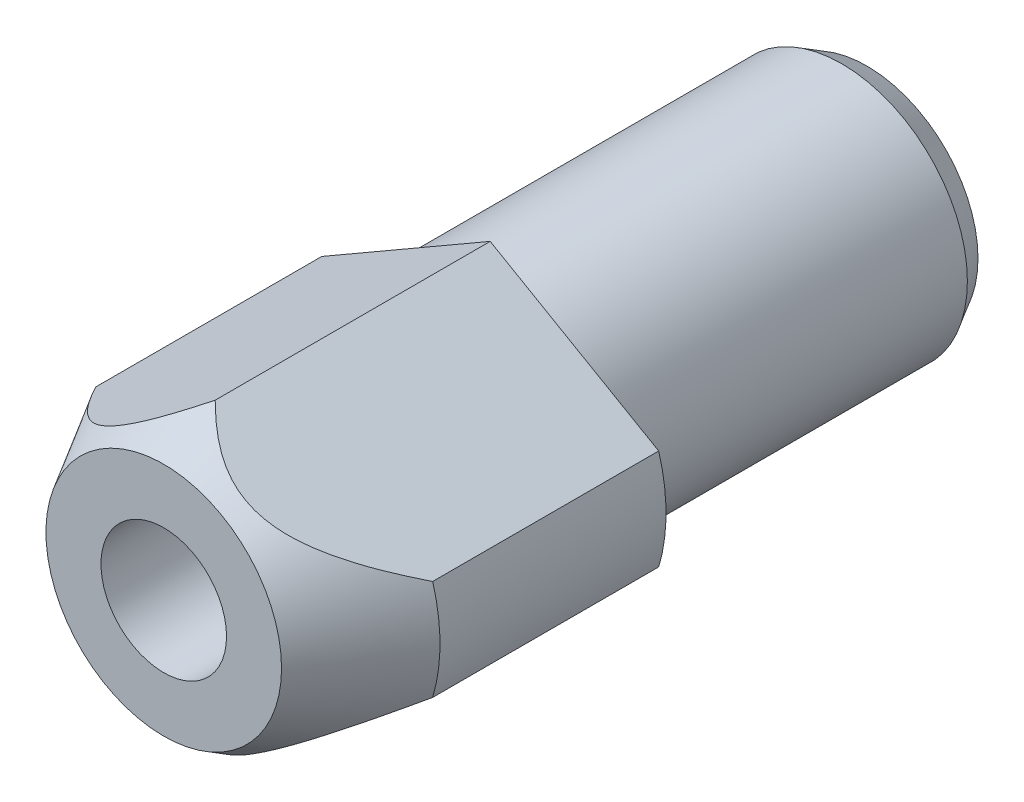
ISO-10303-21;
HEADER;
FILE_DESCRIPTION(('STEP AP214'),'2;1');
FILE_NAME('part.step','',(''),(''),'','','');
FILE_SCHEMA(('AUTOMOTIVE_DESIGN { 1 0 10303 214 1 1 1 1 }'));
ENDSEC;
DATA;
#1=APPLICATION_CONTEXT('core data for automotive mechanical design processes');
#2=APPLICATION_PROTOCOL_DEFINITION('international standard','automotive_design',2000,#1);
#3=PRODUCT_CONTEXT('',#1,'mechanical');
#4=PRODUCT('Part','Part','',(#3));
#5=PRODUCT_RELATED_PRODUCT_CATEGORY('part','',(#4));
#6=PRODUCT_DEFINITION_FORMATION('','',#4);
#7=PRODUCT_DEFINITION_CONTEXT('part definition',#1,'design');
#8=PRODUCT_DEFINITION('design','',#6,#7);
#9=PRODUCT_DEFINITION_SHAPE('','',#8);
#10=(LENGTH_UNIT() NAMED_UNIT(*) SI_UNIT(.MILLI.,.METRE.));
#11=(NAMED_UNIT(*) PLANE_ANGLE_UNIT() SI_UNIT($,.RADIAN.));
#12=(NAMED_UNIT(*) SI_UNIT($,.STERADIAN.) SOLID_ANGLE_UNIT());
#13=UNCERTAINTY_MEASURE_WITH_UNIT(LENGTH_MEASURE(1.E-05),#10,'distance_accuracy_value','');
#14=(GEOMETRIC_REPRESENTATION_CONTEXT(3) GLOBAL_UNCERTAINTY_ASSIGNED_CONTEXT((#13)) GLOBAL_UNIT_ASSIGNED_CONTEXT((#10,
#11,#12)) REPRESENTATION_CONTEXT('',''));
#15=CARTESIAN_POINT('',(0.,0.,0.));
#16=DIRECTION('',(0.,0.,1.));
#17=DIRECTION('',(1.,0.,0.));
#18=AXIS2_PLACEMENT_3D('',#15,#16,#17);
#19=CARTESIAN_POINT('',(5.,0.,0.));
#20=DIRECTION('',(0.,0.,1.));
#21=DIRECTION('',(1.,0.,0.));
#22=AXIS2_PLACEMENT_3D('',#19,#20,#21);
#23=PLANE('',#22);
#24=CARTESIAN_POINT('',(0.,0.,0.));
#25=DIRECTION('',(0.,0.,1.));
#26=DIRECTION('',(1.,0.,0.));
#27=AXIS2_PLACEMENT_3D('',#24,#25,#26);
#28=CIRCLE('',#27,5.);
#29=CARTESIAN_POINT('',(5.,0.,0.));
#30=VERTEX_POINT('',#29);
#31=EDGE_CURVE('E96',#30,#30,#28,.T.);
#32=ORIENTED_EDGE('',*,*,#31,.T.);
#33=EDGE_LOOP('',(#32));
#34=FACE_BOUND('',#33,.T.);
#35=DIRECTION('',(-0.866025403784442,0.5,0.));
#36=VECTOR('',#35,1.);
#37=CARTESIAN_POINT('',(6.70820393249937,2.,0.));
#38=LINE('',#37,#36);
#39=CARTESIAN_POINT('',(6.70820393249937,2.,0.));
#40=VERTEX_POINT('',#39);
#41=CARTESIAN_POINT('',(0.,5.87298334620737,0.));
#42=VERTEX_POINT('',#41);
#43=EDGE_CURVE('E79',#40,#42,#38,.T.);
#44=ORIENTED_EDGE('',*,*,#43,.F.);
#45=CARTESIAN_POINT('',(0.,0.,0.));
#46=DIRECTION('',(0.,0.,1.));
#47=DIRECTION('',(1.,0.,0.));
#48=AXIS2_PLACEMENT_3D('',#45,#46,#47);
#49=CIRCLE('',#48,7.);
#50=CARTESIAN_POINT('',(6.70820393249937,-2.,0.));
#51=VERTEX_POINT('',#50);
#52=EDGE_CURVE('E92',#51,#40,#49,.T.);
#53=ORIENTED_EDGE('',*,*,#52,.F.);
#54=DIRECTION('',(-0.866025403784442,-0.5,0.));
#55=VECTOR('',#54,1.);
#56=CARTESIAN_POINT('',(6.70820393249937,-2.,0.));
#57=LINE('',#56,#55);
#58=CARTESIAN_POINT('',(0.,-5.87298334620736,0.));
#59=VERTEX_POINT('',#58);
#60=EDGE_CURVE('E201',#51,#59,#57,.T.);
#61=ORIENTED_EDGE('',*,*,#60,.T.);
#62=DIRECTION('',(0.866025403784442,-0.5,0.));
#63=VECTOR('',#62,1.);
#64=CARTESIAN_POINT('',(-6.70820393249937,-2.,0.));
#65=LINE('',#64,#63);
#66=CARTESIAN_POINT('',(-6.70820393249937,-2.,0.));
#67=VERTEX_POINT('',#66);
#68=EDGE_CURVE('E91',#67,#59,#65,.T.);
#69=ORIENTED_EDGE('',*,*,#68,.F.);
#70=CARTESIAN_POINT('',(-6.70820393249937,2.,0.));
#71=VERTEX_POINT('',#70);
#72=EDGE_CURVE('E85',#71,#67,#49,.T.);
#73=ORIENTED_EDGE('',*,*,#72,.F.);
#74=DIRECTION('',(0.866025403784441,0.5,0.));
#75=VECTOR('',#74,1.);
#76=CARTESIAN_POINT('',(-6.70820393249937,2.,0.));
#77=LINE('',#76,#75);
#78=EDGE_CURVE('E71',#71,#42,#77,.T.);
#79=ORIENTED_EDGE('',*,*,#78,.T.);
#80=EDGE_LOOP('',(#44,#53,#61,#69,#73,#79));
#81=FACE_BOUND('',#80,.T.);
#82=ADVANCED_FACE('F14',(#34,#81),#23,.F.);
#83=CARTESIAN_POINT('',(0.,0.,30.));
#84=DIRECTION('',(0.,0.,1.));
#85=DIRECTION('',(1.,0.,0.));
#86=AXIS2_PLACEMENT_3D('',#83,#84,#85);
#87=CYLINDRICAL_SURFACE('',#86,7.);
#88=DIRECTION('',(0.,0.,1.));
#89=VECTOR('',#88,1.);
#90=CARTESIAN_POINT('',(6.70820393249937,2.,0.));
#91=LINE('',#90,#89);
#92=CARTESIAN_POINT('',(6.70820393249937,2.,9.));
#93=VERTEX_POINT('',#92);
#94=EDGE_CURVE('E197',#40,#93,#91,.T.);
#95=ORIENTED_EDGE('',*,*,#94,.T.);
#96=CARTESIAN_POINT('',(0.,0.,9.));
#97=DIRECTION('',(0.,0.,1.));
#98=DIRECTION('',(1.,0.,0.));
#99=AXIS2_PLACEMENT_3D('',#96,#97,#98);
#100=CIRCLE('',#99,7.);
#101=CARTESIAN_POINT('',(6.70820393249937,-2.,9.));
#102=VERTEX_POINT('',#101);
#103=EDGE_CURVE('E93',#102,#93,#100,.T.);
#104=ORIENTED_EDGE('',*,*,#103,.F.);
#105=DIRECTION('',(0.,0.,1.));
#106=VECTOR('',#105,1.);
#107=CARTESIAN_POINT('',(6.70820393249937,-2.,0.));
#108=LINE('',#107,#106);
#109=EDGE_CURVE('E209',#51,#102,#108,.T.);
#110=ORIENTED_EDGE('',*,*,#109,.F.);
#111=ORIENTED_EDGE('',*,*,#52,.T.);
#112=EDGE_LOOP('',(#95,#104,#110,#111));
#113=FACE_BOUND('',#112,.T.);
#114=ADVANCED_FACE('F150',(#113),#87,.T.);
#115=CARTESIAN_POINT('',(0.,0.,9.));
#116=DIRECTION('',(0.,0.,-1.));
#117=DIRECTION('',(-1.,0.,0.));
#118=AXIS2_PLACEMENT_3D('',#115,#116,#117);
#119=CONICAL_SURFACE('',#118,7.,0.523598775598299);
#120=CARTESIAN_POINT('',(0.,0.,13.));
#121=DIRECTION('',(0.,0.,1.));
#122=DIRECTION('',(1.,0.,0.));
#123=AXIS2_PLACEMENT_3D('',#120,#121,#122);
#124=CIRCLE('',#123,4.69059892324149);
#125=CARTESIAN_POINT('',(4.69059892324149,0.,13.));
#126=VERTEX_POINT('',#125);
#127=EDGE_CURVE('E191',#126,#126,#124,.T.);
#128=ORIENTED_EDGE('',*,*,#127,.F.);
#129=EDGE_LOOP('',(#128));
#130=FACE_BOUND('',#129,.T.);
#131=CARTESIAN_POINT('',(-0.000200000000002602,5.8730988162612,10.9518500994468));
#132=CARTESIAN_POINT('',(0.0529864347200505,5.84239161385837,11.0050342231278));
#133=CARTESIAN_POINT('',(0.106703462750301,5.81137807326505,11.0575091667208));
#134=CARTESIAN_POINT('',(0.215315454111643,5.74867091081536,11.1608430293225));
#135=CARTESIAN_POINT('',(0.27021074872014,5.7169770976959,11.2117014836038));
#136=CARTESIAN_POINT('',(0.437358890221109,5.62047407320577,11.3620190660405));
#137=CARTESIAN_POINT('',(0.551534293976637,5.55455487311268,11.4586741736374));
#138=CARTESIAN_POINT('',(0.788819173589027,5.41755838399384,11.6445045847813));
#139=CARTESIAN_POINT('',(0.91208446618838,5.34639113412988,11.7334170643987));
#140=CARTESIAN_POINT('',(1.16529399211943,5.20020054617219,11.8970695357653));
#141=CARTESIAN_POINT('',(1.29522262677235,5.12518621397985,11.971840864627));
#142=CARTESIAN_POINT('',(1.50113825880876,5.0063007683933,12.0728579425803));
#143=CARTESIAN_POINT('',(1.57471376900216,4.96382192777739,12.1056861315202));
#144=CARTESIAN_POINT('',(1.72379175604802,4.87775171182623,12.1649793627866));
#145=CARTESIAN_POINT('',(1.79929437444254,4.83416025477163,12.1914439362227));
#146=CARTESIAN_POINT('',(1.95132510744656,4.74638527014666,12.2369981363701));
#147=CARTESIAN_POINT('',(2.02784035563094,4.7022091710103,12.2561445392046));
#148=CARTESIAN_POINT('',(2.18202244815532,4.61319209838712,12.2866655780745));
#149=CARTESIAN_POINT('',(2.25968907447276,4.56835125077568,12.2980416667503));
#150=CARTESIAN_POINT('',(2.4163505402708,4.47790271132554,12.3126377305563));
#151=CARTESIAN_POINT('',(2.49535097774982,4.43229178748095,12.3157786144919));
#152=CARTESIAN_POINT('',(2.65325881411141,4.34112365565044,12.3135398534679));
#153=CARTESIAN_POINT('',(2.73216621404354,4.29556644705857,12.3081603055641));
#154=CARTESIAN_POINT('',(2.88933707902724,4.20482380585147,12.2890977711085));
#155=CARTESIAN_POINT('',(2.96759940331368,4.15963903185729,12.2754023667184));
#156=CARTESIAN_POINT('',(3.12283420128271,4.07001417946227,12.2402403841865));
#157=CARTESIAN_POINT('',(3.19980587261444,4.0255745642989,12.2187691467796));
#158=CARTESIAN_POINT('',(3.37375422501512,3.92514543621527,12.1616717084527));
#159=CARTESIAN_POINT('',(3.47016647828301,3.86948179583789,12.1237542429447));
#160=CARTESIAN_POINT('',(3.65967695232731,3.76006787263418,12.038108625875));
#161=CARTESIAN_POINT('',(3.7527731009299,3.70631878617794,11.9903744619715));
#162=CARTESIAN_POINT('',(3.93635982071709,3.60032494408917,11.8863630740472));
#163=CARTESIAN_POINT('',(4.02681802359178,3.54809887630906,11.8300103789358));
#164=CARTESIAN_POINT('',(4.20431504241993,3.44562092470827,11.710654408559));
#165=CARTESIAN_POINT('',(4.29135478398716,3.39536850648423,11.6476529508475));
#166=CARTESIAN_POINT('',(4.49230790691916,3.27934816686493,11.4931903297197));
#167=CARTESIAN_POINT('',(4.60493225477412,3.21432446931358,11.3995008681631));
#168=CARTESIAN_POINT('',(4.82523970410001,3.0871299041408,11.2046332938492));
#169=CARTESIAN_POINT('',(4.93292034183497,3.02496045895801,11.1034515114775));
#170=CARTESIAN_POINT('',(5.14433636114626,2.90289936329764,10.8950283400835));
#171=CARTESIAN_POINT('',(5.24805862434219,2.84301528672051,10.7877693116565));
#172=CARTESIAN_POINT('',(5.45185763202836,2.72535187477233,10.5687242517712));
#173=CARTESIAN_POINT('',(5.55193392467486,2.66757280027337,10.4569376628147));
#174=CARTESIAN_POINT('',(5.74358661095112,2.55692207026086,10.235978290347));
#175=CARTESIAN_POINT('',(5.83532868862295,2.50395475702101,10.1269963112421));
#176=CARTESIAN_POINT('',(6.01641515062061,2.39940443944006,9.90639842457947));
#177=CARTESIAN_POINT('',(6.1057593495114,2.34782154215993,9.79478231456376));
#178=CARTESIAN_POINT('',(6.2816778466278,2.24625495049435,9.5702575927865));
#179=CARTESIAN_POINT('',(6.36826828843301,2.19626193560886,9.45736579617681));
#180=CARTESIAN_POINT('',(6.53963078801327,2.09732575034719,9.22980351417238));
#181=CARTESIAN_POINT('',(6.62440328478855,2.04838232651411,9.11513346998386));
#182=CARTESIAN_POINT('',(6.70840393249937,1.99988452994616,8.99972516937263));
#183=B_SPLINE_CURVE_WITH_KNOTS('',3,(#131,#132,#133,#134,#135,#136,#137,#138,#139,#140,#141,
#142,#143,#144,#145,#146,#147,#148,#149,#150,#151,#152,#153,#154,#155,#156,#157,#158,#159,#160,
#161,#162,#163,#164,#165,#166,#167,#168,#169,#170,#171,#172,#173,#174,#175,#176,#177,#178,#179,
#180,#181,#182),.UNSPECIFIED.,.F.,.F.,(4,2,2,2,2,2,2,2,2,2,2,2,2,2,2,2,2,2,2,2,2,2,2,2,2,4),(0.,
0.243715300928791,0.487500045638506,0.977552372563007,1.48046379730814,1.98224735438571,
2.25527955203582,2.52833186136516,2.79922055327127,3.0700585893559,3.34348839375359,
3.61691508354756,3.8907510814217,4.16475143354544,4.51700036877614,4.86946568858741,
5.22521580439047,5.5808689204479,6.06133859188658,6.54204516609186,7.02422662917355,
7.50646764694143,7.96236501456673,8.41829753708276,8.87068237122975,9.32295670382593),.UNSPECIFIED.);
#184=CARTESIAN_POINT('',(0.,5.87298334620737,10.9520501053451));
#185=VERTEX_POINT('',#184);
#186=EDGE_CURVE('E9',#185,#93,#183,.T.);
#187=ORIENTED_EDGE('',*,*,#186,.F.);
#188=CARTESIAN_POINT('',(0.000199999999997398,5.87309881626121,10.9518500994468));
#189=CARTESIAN_POINT('',(-0.0529864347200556,5.84239161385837,11.0050342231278));
#190=CARTESIAN_POINT('',(-0.106703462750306,5.81137807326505,11.0575091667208));
#191=CARTESIAN_POINT('',(-0.215315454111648,5.74867091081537,11.1608430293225));
#192=CARTESIAN_POINT('',(-0.270210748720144,5.7169770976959,11.2117014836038));
#193=CARTESIAN_POINT('',(-0.437358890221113,5.62047407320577,11.3620190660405));
#194=CARTESIAN_POINT('',(-0.551534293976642,5.55455487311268,11.4586741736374));
#195=CARTESIAN_POINT('',(-0.788819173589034,5.41755838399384,11.6445045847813));
#196=CARTESIAN_POINT('',(-0.912084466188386,5.34639113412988,11.7334170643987));
#197=CARTESIAN_POINT('',(-1.16529399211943,5.20020054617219,11.8970695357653));
#198=CARTESIAN_POINT('',(-1.29522262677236,5.12518621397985,11.971840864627));
#199=CARTESIAN_POINT('',(-1.50113825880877,5.0063007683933,12.0728579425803));
#200=CARTESIAN_POINT('',(-1.57471376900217,4.96382192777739,12.1056861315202));
#201=CARTESIAN_POINT('',(-1.72379175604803,4.87775171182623,12.1649793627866));
#202=CARTESIAN_POINT('',(-1.79929437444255,4.83416025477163,12.1914439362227));
#203=CARTESIAN_POINT('',(-1.95132510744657,4.74638527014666,12.2369981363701));
#204=CARTESIAN_POINT('',(-2.02784035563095,4.7022091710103,12.2561445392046));
#205=CARTESIAN_POINT('',(-2.18202244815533,4.61319209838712,12.2866655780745));
#206=CARTESIAN_POINT('',(-2.25968907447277,4.56835125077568,12.2980416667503));
#207=CARTESIAN_POINT('',(-2.41635054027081,4.47790271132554,12.3126377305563));
#208=CARTESIAN_POINT('',(-2.49535097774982,4.43229178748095,12.3157786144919));
#209=CARTESIAN_POINT('',(-2.65325881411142,4.34112365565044,12.3135398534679));
#210=CARTESIAN_POINT('',(-2.73216621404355,4.29556644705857,12.3081603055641));
#211=CARTESIAN_POINT('',(-2.88933707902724,4.20482380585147,12.2890977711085));
#212=CARTESIAN_POINT('',(-2.96759940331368,4.15963903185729,12.2754023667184));
#213=CARTESIAN_POINT('',(-3.12283420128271,4.07001417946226,12.2402403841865));
#214=CARTESIAN_POINT('',(-3.19980587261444,4.0255745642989,12.2187691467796));
#215=CARTESIAN_POINT('',(-3.37375422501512,3.92514543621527,12.1616717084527));
#216=CARTESIAN_POINT('',(-3.47016647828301,3.86948179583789,12.1237542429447));
#217=CARTESIAN_POINT('',(-3.65967695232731,3.76006787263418,12.038108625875));
#218=CARTESIAN_POINT('',(-3.75277310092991,3.70631878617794,11.9903744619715));
#219=CARTESIAN_POINT('',(-3.93635982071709,3.60032494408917,11.8863630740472));
#220=CARTESIAN_POINT('',(-4.02681802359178,3.54809887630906,11.8300103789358));
#221=CARTESIAN_POINT('',(-4.20431504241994,3.44562092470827,11.710654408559));
#222=CARTESIAN_POINT('',(-4.29135478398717,3.39536850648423,11.6476529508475));
#223=CARTESIAN_POINT('',(-4.49230790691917,3.27934816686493,11.4931903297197));
#224=CARTESIAN_POINT('',(-4.60493225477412,3.21432446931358,11.3995008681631));
#225=CARTESIAN_POINT('',(-4.82523970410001,3.08712990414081,11.2046332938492));
#226=CARTESIAN_POINT('',(-4.93292034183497,3.02496045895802,11.1034515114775));
#227=CARTESIAN_POINT('',(-5.14433636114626,2.90289936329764,10.8950283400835));
#228=CARTESIAN_POINT('',(-5.2480586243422,2.84301528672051,10.7877693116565));
#229=CARTESIAN_POINT('',(-5.45185763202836,2.72535187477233,10.5687242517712));
#230=CARTESIAN_POINT('',(-5.55193392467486,2.66757280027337,10.4569376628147));
#231=CARTESIAN_POINT('',(-5.74358661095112,2.55692207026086,10.235978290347));
#232=CARTESIAN_POINT('',(-5.83532868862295,2.50395475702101,10.1269963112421));
#233=CARTESIAN_POINT('',(-6.01641515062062,2.39940443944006,9.90639842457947));
#234=CARTESIAN_POINT('',(-6.10575934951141,2.34782154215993,9.79478231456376));
#235=CARTESIAN_POINT('',(-6.2816778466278,2.24625495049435,9.5702575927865));
#236=CARTESIAN_POINT('',(-6.36826828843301,2.19626193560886,9.45736579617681));
#237=CARTESIAN_POINT('',(-6.53963078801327,2.09732575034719,9.22980351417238));
#238=CARTESIAN_POINT('',(-6.62440328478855,2.04838232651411,9.11513346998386));
#239=CARTESIAN_POINT('',(-6.70840393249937,1.99988452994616,8.99972516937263));
#240=B_SPLINE_CURVE_WITH_KNOTS('',3,(#188,#189,#190,#191,#192,#193,#194,#195,#196,#197,#198,
#199,#200,#201,#202,#203,#204,#205,#206,#207,#208,#209,#210,#211,#212,#213,#214,#215,#216,#217,
#218,#219,#220,#221,#222,#223,#224,#225,#226,#227,#228,#229,#230,#231,#232,#233,#234,#235,#236,
#237,#238,#239),.UNSPECIFIED.,.F.,.F.,(4,2,2,2,2,2,2,2,2,2,2,2,2,2,2,2,2,2,2,2,2,2,2,2,2,4),(0.,
0.243715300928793,0.487500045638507,0.977552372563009,1.48046379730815,1.98224735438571,
2.25527955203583,2.52833186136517,2.79922055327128,3.07005858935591,3.34348839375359,
3.61691508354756,3.89075108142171,4.16475143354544,4.51700036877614,4.86946568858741,
5.22521580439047,5.5808689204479,6.06133859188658,6.54204516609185,7.02422662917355,
7.50646764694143,7.96236501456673,8.41829753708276,8.87068237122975,9.32295670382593),.UNSPECIFIED.);
#241=CARTESIAN_POINT('',(-6.70820393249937,2.,9.));
#242=VERTEX_POINT('',#241);
#243=EDGE_CURVE('E28',#185,#242,#240,.T.);
#244=ORIENTED_EDGE('',*,*,#243,.T.);
#245=CARTESIAN_POINT('',(-6.70820393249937,-2.,9.));
#246=VERTEX_POINT('',#245);
#247=EDGE_CURVE('E87',#242,#246,#100,.T.);
#248=ORIENTED_EDGE('',*,*,#247,.T.);
#249=CARTESIAN_POINT('',(0.000199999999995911,-5.8730988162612,10.9518500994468));
#250=CARTESIAN_POINT('',(-0.0529864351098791,-5.8423916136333,11.0050342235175));
#251=CARTESIAN_POINT('',(-0.106703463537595,-5.8113780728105,11.0575091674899));
#252=CARTESIAN_POINT('',(-0.215315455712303,-5.74867090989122,11.1608430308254));
#253=CARTESIAN_POINT('',(-0.270210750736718,-5.71697709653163,11.2117014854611));
#254=CARTESIAN_POINT('',(-0.437358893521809,-5.62047407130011,11.3620190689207));
#255=CARTESIAN_POINT('',(-0.551534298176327,-5.55455487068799,11.4586741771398));
#256=CARTESIAN_POINT('',(-0.788819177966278,-5.41755838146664,11.6445045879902));
#257=CARTESIAN_POINT('',(-0.912084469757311,-5.34639113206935,11.7334170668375));
#258=CARTESIAN_POINT('',(-1.16529399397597,-5.20020054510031,11.8970695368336));
#259=CARTESIAN_POINT('',(-1.29522262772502,-5.12518621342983,11.9718408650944));
#260=CARTESIAN_POINT('',(-1.50113825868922,-5.00630076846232,12.0728579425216));
#261=CARTESIAN_POINT('',(-1.57471376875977,-4.96382192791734,12.105686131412));
#262=CARTESIAN_POINT('',(-1.72379175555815,-4.87775171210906,12.1649793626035));
#263=CARTESIAN_POINT('',(-1.79929437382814,-4.83416025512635,12.1914439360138));
#264=CARTESIAN_POINT('',(-1.95132510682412,-4.74638527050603,12.2369981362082));
#265=CARTESIAN_POINT('',(-2.02784035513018,-4.70220917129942,12.2561445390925));
#266=CARTESIAN_POINT('',(-2.18202244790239,-4.61319209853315,12.2866655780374));
#267=CARTESIAN_POINT('',(-2.25968907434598,-4.56835125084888,12.2980416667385));
#268=CARTESIAN_POINT('',(-2.41635053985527,-4.47790271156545,12.3126377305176));
#269=CARTESIAN_POINT('',(-2.4953509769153,-4.43229178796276,12.3157786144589));
#270=CARTESIAN_POINT('',(-2.65325881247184,-4.34112365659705,12.313539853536));
#271=CARTESIAN_POINT('',(-2.73216621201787,-4.29556644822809,12.3081603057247));
#272=CARTESIAN_POINT('',(-2.88933707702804,-4.2048238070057,12.2890977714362));
#273=CARTESIAN_POINT('',(-2.96759940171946,-4.15963903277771,12.275402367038));
#274=CARTESIAN_POINT('',(-3.12283420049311,-4.07001417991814,12.2402403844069));
#275=CARTESIAN_POINT('',(-3.19980587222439,-4.0255745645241,12.2187691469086));
#276=CARTESIAN_POINT('',(-3.37375423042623,-3.92514543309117,12.1616717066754));
#277=CARTESIAN_POINT('',(-3.47016648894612,-3.86948178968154,12.1237542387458));
#278=CARTESIAN_POINT('',(-3.6596769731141,-3.76006786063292,12.0381086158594));
#279=CARTESIAN_POINT('',(-3.7527731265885,-3.70631877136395,11.990374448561));
#280=CARTESIAN_POINT('',(-3.93635984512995,-3.6003249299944,11.8863630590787));
#281=CARTESIAN_POINT('',(-4.02681804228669,-3.54809886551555,11.830010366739));
#282=CARTESIAN_POINT('',(-4.20431505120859,-3.44562091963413,11.7106544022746));
#283=CARTESIAN_POINT('',(-4.29135478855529,-3.39536850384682,11.6476529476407));
#284=CARTESIAN_POINT('',(-4.49230478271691,-3.27934997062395,11.4931927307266));
#285=CARTESIAN_POINT('',(-4.60492615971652,-3.21432798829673,11.3995059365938));
#286=CARTESIAN_POINT('',(-4.82522791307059,-3.08713671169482,11.2046440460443));
#287=CARTESIAN_POINT('',(-4.93290582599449,-3.02496883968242,11.1034652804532));
#288=CARTESIAN_POINT('',(-5.14431656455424,-2.90291079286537,10.895048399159));
#289=CARTESIAN_POINT('',(-5.24803627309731,-2.84302819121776,10.7877926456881));
#290=CARTESIAN_POINT('',(-5.45183032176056,-2.72536764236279,10.5687542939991));
#291=CARTESIAN_POINT('',(-5.55190421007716,-2.66758995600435,10.4569711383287));
#292=CARTESIAN_POINT('',(-5.74355252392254,-2.55694175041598,10.2360183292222));
#293=CARTESIAN_POINT('',(-5.83529262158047,-2.5039755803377,10.1270394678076));
#294=CARTESIAN_POINT('',(-6.01637519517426,-2.39942750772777,9.90644787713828));
#295=CARTESIAN_POINT('',(-6.10571748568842,-2.3478457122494,9.79483494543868));
#296=CARTESIAN_POINT('',(-6.28163227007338,-2.24628126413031,9.57031655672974));
#297=CARTESIAN_POINT('',(-6.36822090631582,-2.19628929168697,9.45742791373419));
#298=CARTESIAN_POINT('',(-6.53957983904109,-2.09735516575,9.22987196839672));
#299=CARTESIAN_POINT('',(-6.62435057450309,-2.04841275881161,9.11520510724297));
#300=CARTESIAN_POINT('',(-6.70834947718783,-1.99991596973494,8.9998));
#301=B_SPLINE_CURVE_WITH_KNOTS('',3,(#249,#250,#251,#252,#253,#254,#255,#256,#257,#258,#259,
#260,#261,#262,#263,#264,#265,#266,#267,#268,#269,#270,#271,#272,#273,#274,#275,#276,#277,#278,
#279,#280,#281,#282,#283,#284,#285,#286,#287,#288,#289,#290,#291,#292,#293,#294,#295,#296,#297,
#298,#299,#300),.UNSPECIFIED.,.F.,.F.,(4,2,2,2,2,2,2,2,2,2,2,2,2,2,2,2,2,2,2,2,2,2,2,2,2,4),(0.,
0.24371530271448,0.487500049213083,0.977552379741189,1.48046380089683,1.98224735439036,
2.25527955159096,2.52833186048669,2.79922055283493,3.07005858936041,3.34348839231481,
3.61691508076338,3.89075108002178,4.16475143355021,4.51700038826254,4.86946572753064,
5.22521582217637,5.5808689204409,6.06132559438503,6.54201914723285,7.02418747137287,
7.5064153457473,7.962301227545,8.41822226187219,8.87059586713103,9.32285897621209),.UNSPECIFIED.);
#302=CARTESIAN_POINT('',(0.,-5.87298334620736,10.9520501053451));
#303=VERTEX_POINT('',#302);
#304=EDGE_CURVE('E115',#303,#246,#301,.T.);
#305=ORIENTED_EDGE('',*,*,#304,.F.);
#306=CARTESIAN_POINT('',(-0.000200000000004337,-5.8730988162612,10.9518500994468));
#307=CARTESIAN_POINT('',(0.0529864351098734,-5.8423916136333,11.0050342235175));
#308=CARTESIAN_POINT('',(0.106703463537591,-5.8113780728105,11.0575091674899));
#309=CARTESIAN_POINT('',(0.2153154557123,-5.74867090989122,11.1608430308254));
#310=CARTESIAN_POINT('',(0.270210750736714,-5.71697709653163,11.2117014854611));
#311=CARTESIAN_POINT('',(0.437358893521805,-5.62047407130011,11.3620190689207));
#312=CARTESIAN_POINT('',(0.551534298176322,-5.55455487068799,11.4586741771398));
#313=CARTESIAN_POINT('',(0.788819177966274,-5.41755838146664,11.6445045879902));
#314=CARTESIAN_POINT('',(0.912084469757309,-5.34639113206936,11.7334170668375));
#315=CARTESIAN_POINT('',(1.16529399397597,-5.20020054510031,11.8970695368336));
#316=CARTESIAN_POINT('',(1.29522262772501,-5.12518621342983,11.9718408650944));
#317=CARTESIAN_POINT('',(1.50113825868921,-5.00630076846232,12.0728579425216));
#318=CARTESIAN_POINT('',(1.57471376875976,-4.96382192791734,12.105686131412));
#319=CARTESIAN_POINT('',(1.72379175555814,-4.87775171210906,12.1649793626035));
#320=CARTESIAN_POINT('',(1.79929437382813,-4.83416025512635,12.1914439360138));
#321=CARTESIAN_POINT('',(1.95132510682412,-4.74638527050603,12.2369981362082));
#322=CARTESIAN_POINT('',(2.02784035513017,-4.70220917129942,12.2561445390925));
#323=CARTESIAN_POINT('',(2.18202244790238,-4.61319209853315,12.2866655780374));
#324=CARTESIAN_POINT('',(2.25968907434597,-4.56835125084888,12.2980416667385));
#325=CARTESIAN_POINT('',(2.41635053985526,-4.47790271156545,12.3126377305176));
#326=CARTESIAN_POINT('',(2.49535097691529,-4.43229178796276,12.3157786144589));
#327=CARTESIAN_POINT('',(2.65325881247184,-4.34112365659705,12.313539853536));
#328=CARTESIAN_POINT('',(2.73216621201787,-4.29556644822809,12.3081603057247));
#329=CARTESIAN_POINT('',(2.88933707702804,-4.20482380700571,12.2890977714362));
#330=CARTESIAN_POINT('',(2.96759940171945,-4.15963903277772,12.275402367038));
#331=CARTESIAN_POINT('',(3.12283420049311,-4.07001417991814,12.2402403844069));
#332=CARTESIAN_POINT('',(3.19980587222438,-4.0255745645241,12.2187691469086));
#333=CARTESIAN_POINT('',(3.37375423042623,-3.92514543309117,12.1616717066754));
#334=CARTESIAN_POINT('',(3.47016648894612,-3.86948178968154,12.1237542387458));
#335=CARTESIAN_POINT('',(3.65967697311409,-3.76006786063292,12.0381086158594));
#336=CARTESIAN_POINT('',(3.75277312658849,-3.70631877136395,11.990374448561));
#337=CARTESIAN_POINT('',(3.93635984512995,-3.6003249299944,11.8863630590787));
#338=CARTESIAN_POINT('',(4.02681804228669,-3.54809886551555,11.830010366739));
#339=CARTESIAN_POINT('',(4.20431505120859,-3.44562091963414,11.7106544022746));
#340=CARTESIAN_POINT('',(4.29135478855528,-3.39536850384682,11.6476529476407));
#341=CARTESIAN_POINT('',(4.4923047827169,-3.27934997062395,11.4931927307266));
#342=CARTESIAN_POINT('',(4.60492615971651,-3.21432798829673,11.3995059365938));
#343=CARTESIAN_POINT('',(4.82522791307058,-3.08713671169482,11.2046440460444));
#344=CARTESIAN_POINT('',(4.93290582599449,-3.02496883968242,11.1034652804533));
#345=CARTESIAN_POINT('',(5.14431656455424,-2.90291079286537,10.895048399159));
#346=CARTESIAN_POINT('',(5.2480362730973,-2.84302819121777,10.7877926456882));
#347=CARTESIAN_POINT('',(5.45183032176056,-2.72536764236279,10.5687542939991));
#348=CARTESIAN_POINT('',(5.55190421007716,-2.66758995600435,10.4569711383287));
#349=CARTESIAN_POINT('',(5.74355252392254,-2.55694175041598,10.2360183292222));
#350=CARTESIAN_POINT('',(5.83529262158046,-2.5039755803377,10.1270394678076));
#351=CARTESIAN_POINT('',(6.01637519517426,-2.39942750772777,9.90644787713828));
#352=CARTESIAN_POINT('',(6.10571748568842,-2.3478457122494,9.79483494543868));
#353=CARTESIAN_POINT('',(6.28163227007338,-2.24628126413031,9.57031655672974));
#354=CARTESIAN_POINT('',(6.36822090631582,-2.19628929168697,9.45742791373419));
#355=CARTESIAN_POINT('',(6.53957983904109,-2.09735516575,9.22987196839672));
#356=CARTESIAN_POINT('',(6.62435057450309,-2.04841275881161,9.11520510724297));
#357=CARTESIAN_POINT('',(6.70834947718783,-1.99991596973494,8.9998));
#358=B_SPLINE_CURVE_WITH_KNOTS('',3,(#306,#307,#308,#309,#310,#311,#312,#313,#314,#315,#316,
#317,#318,#319,#320,#321,#322,#323,#324,#325,#326,#327,#328,#329,#330,#331,#332,#333,#334,#335,
#336,#337,#338,#339,#340,#341,#342,#343,#344,#345,#346,#347,#348,#349,#350,#351,#352,#353,#354,
#355,#356,#357),.UNSPECIFIED.,.F.,.F.,(4,2,2,2,2,2,2,2,2,2,2,2,2,2,2,2,2,2,2,2,2,2,2,2,2,4),(0.,
0.24371530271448,0.487500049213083,0.977552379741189,1.48046380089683,1.98224735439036,
2.25527955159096,2.52833186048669,2.79922055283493,3.07005858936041,3.34348839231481,
3.61691508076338,3.89075108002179,4.16475143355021,4.51700038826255,4.86946572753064,
5.22521582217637,5.5808689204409,6.06132559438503,6.54201914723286,7.02418747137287,
7.50641534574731,7.962301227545,8.4182222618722,8.87059586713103,9.3228589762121),.UNSPECIFIED.);
#359=EDGE_CURVE('E122',#303,#102,#358,.T.);
#360=ORIENTED_EDGE('',*,*,#359,.T.);
#361=ORIENTED_EDGE('',*,*,#103,.T.);
#362=EDGE_LOOP('',(#187,#244,#248,#305,#360,#361));
#363=FACE_BOUND('',#362,.T.);
#364=ADVANCED_FACE('F128',(#130,#363),#119,.T.);
#365=CARTESIAN_POINT('',(0.,0.,-11.));
#366=DIRECTION('',(0.,0.,1.));
#367=DIRECTION('',(1.,0.,0.));
#368=AXIS2_PLACEMENT_3D('',#365,#366,#367);
#369=PLANE('',#368);
#370=CARTESIAN_POINT('',(0.,0.,-11.));
#371=DIRECTION('',(0.,0.,1.));
#372=DIRECTION('',(1.,0.,0.));
#373=AXIS2_PLACEMENT_3D('',#370,#371,#372);
#374=CIRCLE('',#373,1.);
#375=CARTESIAN_POINT('',(1.,0.,-11.));
#376=VERTEX_POINT('',#375);
#377=EDGE_CURVE('E112',#376,#376,#374,.T.);
#378=ORIENTED_EDGE('',*,*,#377,.F.);
#379=EDGE_LOOP('',(#378));
#380=FACE_BOUND('',#379,.T.);
#381=ADVANCED_FACE('F16',(#380),#369,.F.);
#382=CARTESIAN_POINT('',(0.,0.,30.));
#383=DIRECTION('',(0.,0.,1.));
#384=DIRECTION('',(1.,0.,0.));
#385=AXIS2_PLACEMENT_3D('',#382,#383,#384);
#386=CYLINDRICAL_SURFACE('',#385,1.);
#387=CARTESIAN_POINT('',(0.,0.,-15.));
#388=DIRECTION('',(0.,0.,1.));
#389=DIRECTION('',(1.,0.,0.));
#390=AXIS2_PLACEMENT_3D('',#387,#388,#389);
#391=CIRCLE('',#390,1.);
#392=CARTESIAN_POINT('',(1.,0.,-15.));
#393=VERTEX_POINT('',#392);
#394=EDGE_CURVE('E109',#393,#393,#391,.T.);
#395=ORIENTED_EDGE('',*,*,#394,.F.);
#396=EDGE_LOOP('',(#395));
#397=FACE_BOUND('',#396,.T.);
#398=ORIENTED_EDGE('',*,*,#377,.T.);
#399=EDGE_LOOP('',(#398));
#400=FACE_BOUND('',#399,.T.);
#401=ADVANCED_FACE('F170',(#397,#400),#386,.F.);
#402=CARTESIAN_POINT('',(1.,0.,-15.));
#403=DIRECTION('',(0.,0.,1.));
#404=DIRECTION('',(1.,0.,0.));
#405=AXIS2_PLACEMENT_3D('',#402,#403,#404);
#406=PLANE('',#405);
#407=CARTESIAN_POINT('',(0.,0.,-15.));
#408=DIRECTION('',(0.,0.,1.));
#409=DIRECTION('',(1.,0.,0.));
#410=AXIS2_PLACEMENT_3D('',#407,#408,#409);
#411=CIRCLE('',#410,4.42264973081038);
#412=CARTESIAN_POINT('',(4.42264973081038,0.,-15.));
#413=VERTEX_POINT('',#412);
#414=EDGE_CURVE('E106',#413,#413,#411,.T.);
#415=ORIENTED_EDGE('',*,*,#414,.F.);
#416=EDGE_LOOP('',(#415));
#417=FACE_BOUND('',#416,.T.);
#418=ORIENTED_EDGE('',*,*,#394,.T.);
#419=EDGE_LOOP('',(#418));
#420=FACE_BOUND('',#419,.T.);
#421=ADVANCED_FACE('F167',(#417,#420),#406,.F.);
#422=CARTESIAN_POINT('',(0.,0.,-14.));
#423=DIRECTION('',(0.,0.,1.));
#424=DIRECTION('',(1.,0.,0.));
#425=AXIS2_PLACEMENT_3D('',#422,#423,#424);
#426=CONICAL_SURFACE('',#425,5.,0.523598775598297);
#427=ORIENTED_EDGE('',*,*,#414,.T.);
#428=EDGE_LOOP('',(#427));
#429=FACE_BOUND('',#428,.T.);
#430=CARTESIAN_POINT('',(0.,0.,-14.));
#431=DIRECTION('',(0.,0.,1.));
#432=DIRECTION('',(1.,0.,0.));
#433=AXIS2_PLACEMENT_3D('',#430,#431,#432);
#434=CIRCLE('',#433,5.);
#435=CARTESIAN_POINT('',(5.,0.,-14.));
#436=VERTEX_POINT('',#435);
#437=EDGE_CURVE('E103',#436,#436,#434,.T.);
#438=ORIENTED_EDGE('',*,*,#437,.F.);
#439=EDGE_LOOP('',(#438));
#440=FACE_BOUND('',#439,.T.);
#441=ADVANCED_FACE('F163',(#429,#440),#426,.T.);
#442=CARTESIAN_POINT('',(0.,0.,30.));
#443=DIRECTION('',(0.,0.,1.));
#444=DIRECTION('',(1.,0.,0.));
#445=AXIS2_PLACEMENT_3D('',#442,#443,#444);
#446=CYLINDRICAL_SURFACE('',#445,5.);
#447=ORIENTED_EDGE('',*,*,#31,.F.);
#448=EDGE_LOOP('',(#447));
#449=FACE_BOUND('',#448,.T.);
#450=ORIENTED_EDGE('',*,*,#437,.T.);
#451=EDGE_LOOP('',(#450));
#452=FACE_BOUND('',#451,.T.);
#453=ADVANCED_FACE('F149',(#449,#452),#446,.T.);
#454=ORIENTED_EDGE('',*,*,#247,.F.);
#455=DIRECTION('',(0.,0.,1.));
#456=VECTOR('',#455,1.);
#457=CARTESIAN_POINT('',(-6.70820393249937,2.,0.));
#458=LINE('',#457,#456);
#459=EDGE_CURVE('E35',#71,#242,#458,.T.);
#460=ORIENTED_EDGE('',*,*,#459,.F.);
#461=ORIENTED_EDGE('',*,*,#72,.T.);
#462=DIRECTION('',(0.,0.,1.));
#463=VECTOR('',#462,1.);
#464=CARTESIAN_POINT('',(-6.70820393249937,-2.,0.));
#465=LINE('',#464,#463);
#466=EDGE_CURVE('E207',#67,#246,#465,.T.);
#467=ORIENTED_EDGE('',*,*,#466,.T.);
#468=EDGE_LOOP('',(#454,#460,#461,#467));
#469=FACE_BOUND('',#468,.T.);
#470=ADVANCED_FACE('F83',(#469),#87,.T.);
#471=CARTESIAN_POINT('',(4.69059892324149,0.,13.));
#472=DIRECTION('',(0.,0.,-1.));
#473=DIRECTION('',(-1.,0.,0.));
#474=AXIS2_PLACEMENT_3D('',#471,#472,#473);
#475=PLANE('',#474);
#476=CARTESIAN_POINT('',(0.,0.,13.));
#477=DIRECTION('',(0.,0.,1.));
#478=DIRECTION('',(1.,0.,0.));
#479=AXIS2_PLACEMENT_3D('',#476,#477,#478);
#480=CIRCLE('',#479,2.5);
#481=CARTESIAN_POINT('',(2.5,0.,13.));
#482=VERTEX_POINT('',#481);
#483=EDGE_CURVE('E211',#482,#482,#480,.T.);
#484=ORIENTED_EDGE('',*,*,#483,.F.);
#485=EDGE_LOOP('',(#484));
#486=FACE_BOUND('',#485,.T.);
#487=ORIENTED_EDGE('',*,*,#127,.T.);
#488=EDGE_LOOP('',(#487));
#489=FACE_BOUND('',#488,.T.);
#490=ADVANCED_FACE('F141',(#486,#489),#475,.F.);
#491=CARTESIAN_POINT('',(0.,0.,30.));
#492=DIRECTION('',(0.,0.,1.));
#493=DIRECTION('',(1.,0.,0.));
#494=AXIS2_PLACEMENT_3D('',#491,#492,#493);
#495=CYLINDRICAL_SURFACE('',#494,2.5);
#496=CARTESIAN_POINT('',(0.,0.,5.));
#497=DIRECTION('',(0.,0.,1.));
#498=DIRECTION('',(1.,0.,0.));
#499=AXIS2_PLACEMENT_3D('',#496,#497,#498);
#500=CIRCLE('',#499,2.5);
#501=CARTESIAN_POINT('',(2.5,0.,5.));
#502=VERTEX_POINT('',#501);
#503=EDGE_CURVE('E324',#502,#502,#500,.T.);
#504=ORIENTED_EDGE('',*,*,#503,.F.);
#505=EDGE_LOOP('',(#504));
#506=FACE_BOUND('',#505,.T.);
#507=ORIENTED_EDGE('',*,*,#483,.T.);
#508=EDGE_LOOP('',(#507));
#509=FACE_BOUND('',#508,.T.);
#510=ADVANCED_FACE('F139',(#506,#509),#495,.F.);
#511=CARTESIAN_POINT('',(6.70820393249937,-2.,0.));
#512=DIRECTION('',(-0.5,0.866025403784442,0.));
#513=DIRECTION('',(-0.866025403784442,-0.5,0.));
#514=AXIS2_PLACEMENT_3D('',#511,#512,#513);
#515=PLANE('',#514);
#516=DIRECTION('',(0.,0.,1.));
#517=VECTOR('',#516,1.);
#518=CARTESIAN_POINT('',(0.,-5.87298334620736,0.));
#519=LINE('',#518,#517);
#520=EDGE_CURVE('E43',#59,#303,#519,.T.);
#521=ORIENTED_EDGE('',*,*,#520,.F.);
#522=ORIENTED_EDGE('',*,*,#60,.F.);
#523=ORIENTED_EDGE('',*,*,#109,.T.);
#524=ORIENTED_EDGE('',*,*,#359,.F.);
#525=EDGE_LOOP('',(#521,#522,#523,#524));
#526=FACE_BOUND('',#525,.T.);
#527=ADVANCED_FACE('F137',(#526),#515,.F.);
#528=CARTESIAN_POINT('',(-6.70820393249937,-2.,0.));
#529=DIRECTION('',(-0.5,-0.866025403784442,0.));
#530=DIRECTION('',(0.866025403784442,-0.5,0.));
#531=AXIS2_PLACEMENT_3D('',#528,#529,#530);
#532=PLANE('',#531);
#533=ORIENTED_EDGE('',*,*,#304,.T.);
#534=ORIENTED_EDGE('',*,*,#466,.F.);
#535=ORIENTED_EDGE('',*,*,#68,.T.);
#536=ORIENTED_EDGE('',*,*,#520,.T.);
#537=EDGE_LOOP('',(#533,#534,#535,#536));
#538=FACE_BOUND('',#537,.T.);
#539=ADVANCED_FACE('F132',(#538),#532,.T.);
#540=CARTESIAN_POINT('',(6.70820393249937,2.,0.));
#541=DIRECTION('',(0.5,0.866025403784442,0.));
#542=DIRECTION('',(-0.866025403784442,0.5,0.));
#543=AXIS2_PLACEMENT_3D('',#540,#541,#542);
#544=PLANE('',#543);
#545=ORIENTED_EDGE('',*,*,#186,.T.);
#546=ORIENTED_EDGE('',*,*,#94,.F.);
#547=ORIENTED_EDGE('',*,*,#43,.T.);
#548=DIRECTION('',(0.,0.,1.));
#549=VECTOR('',#548,1.);
#550=CARTESIAN_POINT('',(0.,5.87298334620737,0.));
#551=LINE('',#550,#549);
#552=EDGE_CURVE('E74',#42,#185,#551,.T.);
#553=ORIENTED_EDGE('',*,*,#552,.T.);
#554=EDGE_LOOP('',(#545,#546,#547,#553));
#555=FACE_BOUND('',#554,.T.);
#556=ADVANCED_FACE('F136',(#555),#544,.T.);
#557=CARTESIAN_POINT('',(-6.70820393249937,2.,0.));
#558=DIRECTION('',(0.5,-0.866025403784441,0.));
#559=DIRECTION('',(0.866025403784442,0.5,0.));
#560=AXIS2_PLACEMENT_3D('',#557,#558,#559);
#561=PLANE('',#560);
#562=ORIENTED_EDGE('',*,*,#552,.F.);
#563=ORIENTED_EDGE('',*,*,#78,.F.);
#564=ORIENTED_EDGE('',*,*,#459,.T.);
#565=ORIENTED_EDGE('',*,*,#243,.F.);
#566=EDGE_LOOP('',(#562,#563,#564,#565));
#567=FACE_BOUND('',#566,.T.);
#568=ADVANCED_FACE('F72',(#567),#561,.F.);
#569=CARTESIAN_POINT('',(0.,0.,5.));
#570=DIRECTION('',(0.,0.,1.));
#571=DIRECTION('',(1.,0.,0.));
#572=AXIS2_PLACEMENT_3D('',#569,#570,#571);
#573=PLANE('',#572);
#574=ORIENTED_EDGE('',*,*,#503,.T.);
#575=EDGE_LOOP('',(#574));
#576=FACE_BOUND('',#575,.T.);
#577=ADVANCED_FACE('F223',(#576),#573,.T.);
#578=CLOSED_SHELL('',(#82,#114,#364,#381,#401,#421,#441,#453,#470,#490,#510,#527,#539,#556,#568,#577));
#579=MANIFOLD_SOLID_BREP('B1',#578);
#580=ADVANCED_BREP_SHAPE_REPRESENTATION('',(#18,#579),#14);
#581=SHAPE_DEFINITION_REPRESENTATION(#9,#580);
ENDSEC;
END-ISO-10303-21;
